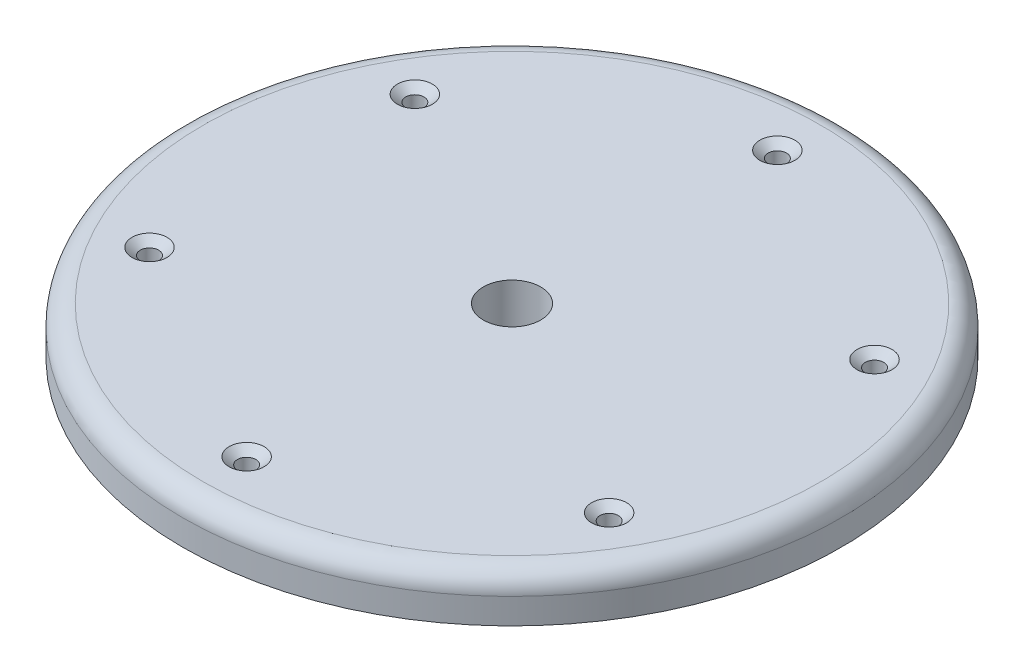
ISO-10303-21;
HEADER;
FILE_DESCRIPTION(('STEP AP214'),'2;1');
FILE_NAME('part.step','',(''),(''),'','','');
FILE_SCHEMA(('AUTOMOTIVE_DESIGN { 1 0 10303 214 1 1 1 1 }'));
ENDSEC;
DATA;
#1=APPLICATION_CONTEXT('core data for automotive mechanical design processes');
#2=APPLICATION_PROTOCOL_DEFINITION('international standard','automotive_design',2000,#1);
#3=PRODUCT_CONTEXT('',#1,'mechanical');
#4=PRODUCT('Part','Part','',(#3));
#5=PRODUCT_RELATED_PRODUCT_CATEGORY('part','',(#4));
#6=PRODUCT_DEFINITION_FORMATION('','',#4);
#7=PRODUCT_DEFINITION_CONTEXT('part definition',#1,'design');
#8=PRODUCT_DEFINITION('design','',#6,#7);
#9=PRODUCT_DEFINITION_SHAPE('','',#8);
#10=(LENGTH_UNIT() NAMED_UNIT(*) SI_UNIT(.MILLI.,.METRE.));
#11=(NAMED_UNIT(*) PLANE_ANGLE_UNIT() SI_UNIT($,.RADIAN.));
#12=(NAMED_UNIT(*) SI_UNIT($,.STERADIAN.) SOLID_ANGLE_UNIT());
#13=UNCERTAINTY_MEASURE_WITH_UNIT(LENGTH_MEASURE(1.E-05),#10,'distance_accuracy_value','');
#14=(GEOMETRIC_REPRESENTATION_CONTEXT(3) GLOBAL_UNCERTAINTY_ASSIGNED_CONTEXT((#13)) GLOBAL_UNIT_ASSIGNED_CONTEXT((#10,
#11,#12)) REPRESENTATION_CONTEXT('',''));
#15=CARTESIAN_POINT('',(0.,0.,0.));
#16=DIRECTION('',(0.,0.,1.));
#17=DIRECTION('',(1.,0.,0.));
#18=AXIS2_PLACEMENT_3D('',#15,#16,#17);
#19=CARTESIAN_POINT('',(0.,17.018,0.));
#20=DIRECTION('',(0.,-1.,0.));
#21=DIRECTION('',(0.,0.,-1.));
#22=AXIS2_PLACEMENT_3D('',#19,#20,#21);
#23=CYLINDRICAL_SURFACE('',#22,121.229415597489);
#24=CARTESIAN_POINT('',(0.,9.398,0.));
#25=DIRECTION('',(0.,1.,0.));
#26=DIRECTION('',(0.,0.,1.));
#27=AXIS2_PLACEMENT_3D('',#24,#25,#26);
#28=CIRCLE('',#27,121.229415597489);
#29=CARTESIAN_POINT('',(0.,9.398,121.229415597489));
#30=VERTEX_POINT('',#29);
#31=EDGE_CURVE('E10',#30,#30,#28,.F.);
#32=ORIENTED_EDGE('',*,*,#31,.T.);
#33=EDGE_LOOP('',(#32));
#34=FACE_BOUND('',#33,.T.);
#35=CARTESIAN_POINT('',(0.,0.,0.));
#36=DIRECTION('',(0.,1.,0.));
#37=DIRECTION('',(0.,0.,1.));
#38=AXIS2_PLACEMENT_3D('',#35,#36,#37);
#39=CIRCLE('',#38,121.229415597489);
#40=CARTESIAN_POINT('',(0.,0.,121.229415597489));
#41=VERTEX_POINT('',#40);
#42=EDGE_CURVE('E42',#41,#41,#39,.T.);
#43=ORIENTED_EDGE('',*,*,#42,.T.);
#44=EDGE_LOOP('',(#43));
#45=FACE_BOUND('',#44,.T.);
#46=ADVANCED_FACE('F31',(#34,#45),#23,.T.);
#47=CARTESIAN_POINT('',(0.,17.018,0.));
#48=DIRECTION('',(0.,1.,0.));
#49=DIRECTION('',(0.,0.,1.));
#50=AXIS2_PLACEMENT_3D('',#47,#48,#49);
#51=PLANE('',#50);
#52=CARTESIAN_POINT('',(0.,17.018,0.));
#53=DIRECTION('',(0.,1.,0.));
#54=DIRECTION('',(0.,0.,1.));
#55=AXIS2_PLACEMENT_3D('',#52,#53,#54);
#56=CIRCLE('',#55,113.609415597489);
#57=CARTESIAN_POINT('',(0.,17.018,113.609415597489));
#58=VERTEX_POINT('',#57);
#59=EDGE_CURVE('E38',#58,#58,#56,.T.);
#60=ORIENTED_EDGE('',*,*,#59,.T.);
#61=EDGE_LOOP('',(#60));
#62=FACE_BOUND('',#61,.T.);
#63=CARTESIAN_POINT('',(-84.5411543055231,17.018,-48.8098581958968));
#64=DIRECTION('',(0.,1.,0.));
#65=DIRECTION('',(0.,0.,1.));
#66=AXIS2_PLACEMENT_3D('',#63,#64,#65);
#67=CIRCLE('',#66,6.4389);
#68=CARTESIAN_POINT('',(-84.5411543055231,17.018,-42.3709581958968));
#69=VERTEX_POINT('',#68);
#70=EDGE_CURVE('E105',#69,#69,#67,.T.);
#71=ORIENTED_EDGE('',*,*,#70,.F.);
#72=EDGE_LOOP('',(#71));
#73=FACE_BOUND('',#72,.T.);
#74=CARTESIAN_POINT('',(-84.5411543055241,17.018,48.809858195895));
#75=DIRECTION('',(0.,1.,0.));
#76=DIRECTION('',(0.,0.,1.));
#77=AXIS2_PLACEMENT_3D('',#74,#75,#76);
#78=CIRCLE('',#77,6.4389);
#79=CARTESIAN_POINT('',(-84.5411543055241,17.018,55.248758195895));
#80=VERTEX_POINT('',#79);
#81=EDGE_CURVE('E96',#80,#80,#78,.T.);
#82=ORIENTED_EDGE('',*,*,#81,.F.);
#83=EDGE_LOOP('',(#82));
#84=FACE_BOUND('',#83,.T.);
#85=CARTESIAN_POINT('',(84.5411543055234,17.018,48.8098581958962));
#86=DIRECTION('',(0.,1.,0.));
#87=DIRECTION('',(0.,0.,1.));
#88=AXIS2_PLACEMENT_3D('',#85,#86,#87);
#89=CIRCLE('',#88,6.4389);
#90=CARTESIAN_POINT('',(84.5411543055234,17.018,55.2487581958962));
#91=VERTEX_POINT('',#90);
#92=EDGE_CURVE('E87',#91,#91,#89,.T.);
#93=ORIENTED_EDGE('',*,*,#92,.F.);
#94=EDGE_LOOP('',(#93));
#95=FACE_BOUND('',#94,.T.);
#96=CARTESIAN_POINT('',(84.5411543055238,17.018,-48.8098581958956));
#97=DIRECTION('',(0.,1.,0.));
#98=DIRECTION('',(0.,0.,1.));
#99=AXIS2_PLACEMENT_3D('',#96,#97,#98);
#100=CIRCLE('',#99,6.4389);
#101=CARTESIAN_POINT('',(84.5411543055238,17.018,-42.3709581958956));
#102=VERTEX_POINT('',#101);
#103=EDGE_CURVE('E78',#102,#102,#100,.T.);
#104=ORIENTED_EDGE('',*,*,#103,.F.);
#105=EDGE_LOOP('',(#104));
#106=FACE_BOUND('',#105,.T.);
#107=CARTESIAN_POINT('',(0.,17.018,0.));
#108=DIRECTION('',(0.,1.,0.));
#109=DIRECTION('',(0.,0.,1.));
#110=AXIS2_PLACEMENT_3D('',#107,#108,#109);
#111=CIRCLE('',#110,10.5620076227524);
#112=CARTESIAN_POINT('',(0.,17.018,10.5620076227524));
#113=VERTEX_POINT('',#112);
#114=EDGE_CURVE('E67',#113,#113,#111,.T.);
#115=ORIENTED_EDGE('',*,*,#114,.F.);
#116=EDGE_LOOP('',(#115));
#117=FACE_BOUND('',#116,.T.);
#118=CARTESIAN_POINT('',(0.,17.018,97.6197163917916));
#119=DIRECTION('',(0.,1.,0.));
#120=DIRECTION('',(0.,0.,1.));
#121=AXIS2_PLACEMENT_3D('',#118,#119,#120);
#122=CIRCLE('',#121,6.4389);
#123=CARTESIAN_POINT('',(0.,17.018,104.058616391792));
#124=VERTEX_POINT('',#123);
#125=EDGE_CURVE('E63',#124,#124,#122,.T.);
#126=ORIENTED_EDGE('',*,*,#125,.F.);
#127=EDGE_LOOP('',(#126));
#128=FACE_BOUND('',#127,.T.);
#129=CARTESIAN_POINT('',(0.,17.018,-97.6197163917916));
#130=DIRECTION('',(0.,1.,0.));
#131=DIRECTION('',(0.,0.,1.));
#132=AXIS2_PLACEMENT_3D('',#129,#130,#131);
#133=CIRCLE('',#132,6.4389);
#134=CARTESIAN_POINT('',(0.,17.018,-91.1808163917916));
#135=VERTEX_POINT('',#134);
#136=EDGE_CURVE('E54',#135,#135,#133,.T.);
#137=ORIENTED_EDGE('',*,*,#136,.F.);
#138=EDGE_LOOP('',(#137));
#139=FACE_BOUND('',#138,.T.);
#140=ADVANCED_FACE('F111',(#62,#73,#84,#95,#106,#117,#128,#139),#51,.T.);
#141=CARTESIAN_POINT('',(0.,0.,0.));
#142=DIRECTION('',(0.,1.,0.));
#143=DIRECTION('',(0.,0.,1.));
#144=AXIS2_PLACEMENT_3D('',#141,#142,#143);
#145=PLANE('',#144);
#146=CARTESIAN_POINT('',(-84.5411543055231,0.,-48.8098581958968));
#147=DIRECTION('',(0.,1.,0.));
#148=DIRECTION('',(0.,0.,1.));
#149=AXIS2_PLACEMENT_3D('',#146,#147,#148);
#150=CIRCLE('',#149,3.3782);
#151=CARTESIAN_POINT('',(-84.5411543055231,0.,-45.4316581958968));
#152=VERTEX_POINT('',#151);
#153=EDGE_CURVE('E99',#152,#152,#150,.T.);
#154=ORIENTED_EDGE('',*,*,#153,.T.);
#155=EDGE_LOOP('',(#154));
#156=FACE_BOUND('',#155,.T.);
#157=CARTESIAN_POINT('',(-84.5411543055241,0.,48.809858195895));
#158=DIRECTION('',(0.,1.,0.));
#159=DIRECTION('',(0.,0.,1.));
#160=AXIS2_PLACEMENT_3D('',#157,#158,#159);
#161=CIRCLE('',#160,3.3782);
#162=CARTESIAN_POINT('',(-84.5411543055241,0.,52.188058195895));
#163=VERTEX_POINT('',#162);
#164=EDGE_CURVE('E90',#163,#163,#161,.T.);
#165=ORIENTED_EDGE('',*,*,#164,.T.);
#166=EDGE_LOOP('',(#165));
#167=FACE_BOUND('',#166,.T.);
#168=CARTESIAN_POINT('',(84.5411543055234,0.,48.8098581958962));
#169=DIRECTION('',(0.,1.,0.));
#170=DIRECTION('',(0.,0.,1.));
#171=AXIS2_PLACEMENT_3D('',#168,#169,#170);
#172=CIRCLE('',#171,3.3782);
#173=CARTESIAN_POINT('',(84.5411543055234,0.,52.1880581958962));
#174=VERTEX_POINT('',#173);
#175=EDGE_CURVE('E81',#174,#174,#172,.T.);
#176=ORIENTED_EDGE('',*,*,#175,.T.);
#177=EDGE_LOOP('',(#176));
#178=FACE_BOUND('',#177,.T.);
#179=CARTESIAN_POINT('',(84.5411543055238,0.,-48.8098581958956));
#180=DIRECTION('',(0.,1.,0.));
#181=DIRECTION('',(0.,0.,1.));
#182=AXIS2_PLACEMENT_3D('',#179,#180,#181);
#183=CIRCLE('',#182,3.3782);
#184=CARTESIAN_POINT('',(84.5411543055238,0.,-45.4316581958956));
#185=VERTEX_POINT('',#184);
#186=EDGE_CURVE('E70',#185,#185,#183,.T.);
#187=ORIENTED_EDGE('',*,*,#186,.T.);
#188=EDGE_LOOP('',(#187));
#189=FACE_BOUND('',#188,.T.);
#190=CARTESIAN_POINT('',(0.,0.,0.));
#191=DIRECTION('',(0.,1.,0.));
#192=DIRECTION('',(0.,0.,1.));
#193=AXIS2_PLACEMENT_3D('',#190,#191,#192);
#194=CIRCLE('',#193,10.5620076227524);
#195=CARTESIAN_POINT('',(0.,0.,10.5620076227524));
#196=VERTEX_POINT('',#195);
#197=EDGE_CURVE('E66',#196,#196,#194,.T.);
#198=ORIENTED_EDGE('',*,*,#197,.T.);
#199=EDGE_LOOP('',(#198));
#200=FACE_BOUND('',#199,.T.);
#201=CARTESIAN_POINT('',(0.,0.,97.6197163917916));
#202=DIRECTION('',(0.,1.,0.));
#203=DIRECTION('',(0.,0.,1.));
#204=AXIS2_PLACEMENT_3D('',#201,#202,#203);
#205=CIRCLE('',#204,3.3782);
#206=CARTESIAN_POINT('',(0.,0.,100.997916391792));
#207=VERTEX_POINT('',#206);
#208=EDGE_CURVE('E57',#207,#207,#205,.T.);
#209=ORIENTED_EDGE('',*,*,#208,.T.);
#210=EDGE_LOOP('',(#209));
#211=FACE_BOUND('',#210,.T.);
#212=CARTESIAN_POINT('',(0.,0.,-97.6197163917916));
#213=DIRECTION('',(0.,1.,0.));
#214=DIRECTION('',(0.,0.,1.));
#215=AXIS2_PLACEMENT_3D('',#212,#213,#214);
#216=CIRCLE('',#215,3.3782);
#217=CARTESIAN_POINT('',(0.,0.,-94.2415163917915));
#218=VERTEX_POINT('',#217);
#219=EDGE_CURVE('E46',#218,#218,#216,.T.);
#220=ORIENTED_EDGE('',*,*,#219,.T.);
#221=EDGE_LOOP('',(#220));
#222=FACE_BOUND('',#221,.T.);
#223=ORIENTED_EDGE('',*,*,#42,.F.);
#224=EDGE_LOOP('',(#223));
#225=FACE_BOUND('',#224,.T.);
#226=ADVANCED_FACE('F114',(#156,#167,#178,#189,#200,#211,#222,#225),#145,.F.);
#227=CARTESIAN_POINT('',(0.,17.018,-97.6197163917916));
#228=DIRECTION('',(0.,1.,0.));
#229=DIRECTION('',(0.,0.,1.));
#230=AXIS2_PLACEMENT_3D('',#227,#228,#229);
#231=CYLINDRICAL_SURFACE('',#230,3.3782);
#232=ORIENTED_EDGE('',*,*,#219,.F.);
#233=EDGE_LOOP('',(#232));
#234=FACE_BOUND('',#233,.T.);
#235=CARTESIAN_POINT('',(0.,14.4497677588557,-97.6197163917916));
#236=DIRECTION('',(0.,1.,0.));
#237=DIRECTION('',(0.,0.,1.));
#238=AXIS2_PLACEMENT_3D('',#235,#236,#237);
#239=CIRCLE('',#238,3.3782);
#240=CARTESIAN_POINT('',(0.,14.4497677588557,-94.2415163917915));
#241=VERTEX_POINT('',#240);
#242=EDGE_CURVE('E51',#241,#241,#239,.T.);
#243=ORIENTED_EDGE('',*,*,#242,.T.);
#244=EDGE_LOOP('',(#243));
#245=FACE_BOUND('',#244,.T.);
#246=ADVANCED_FACE('F131',(#234,#245),#231,.F.);
#247=CARTESIAN_POINT('',(0.,17.018,-97.6197163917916));
#248=DIRECTION('',(0.,1.,0.));
#249=DIRECTION('',(0.,0.,1.));
#250=AXIS2_PLACEMENT_3D('',#247,#248,#249);
#251=CONICAL_SURFACE('',#250,6.4389,0.872664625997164);
#252=ORIENTED_EDGE('',*,*,#242,.F.);
#253=EDGE_LOOP('',(#252));
#254=FACE_BOUND('',#253,.T.);
#255=ORIENTED_EDGE('',*,*,#136,.T.);
#256=EDGE_LOOP('',(#255));
#257=FACE_BOUND('',#256,.T.);
#258=ADVANCED_FACE('F128',(#254,#257),#251,.F.);
#259=CARTESIAN_POINT('',(0.,17.018,97.6197163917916));
#260=DIRECTION('',(0.,1.,0.));
#261=DIRECTION('',(0.,0.,1.));
#262=AXIS2_PLACEMENT_3D('',#259,#260,#261);
#263=CYLINDRICAL_SURFACE('',#262,3.3782);
#264=ORIENTED_EDGE('',*,*,#208,.F.);
#265=EDGE_LOOP('',(#264));
#266=FACE_BOUND('',#265,.T.);
#267=CARTESIAN_POINT('',(0.,14.4497677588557,97.6197163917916));
#268=DIRECTION('',(0.,1.,0.));
#269=DIRECTION('',(0.,0.,1.));
#270=AXIS2_PLACEMENT_3D('',#267,#268,#269);
#271=CIRCLE('',#270,3.3782);
#272=CARTESIAN_POINT('',(0.,14.4497677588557,100.997916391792));
#273=VERTEX_POINT('',#272);
#274=EDGE_CURVE('E60',#273,#273,#271,.T.);
#275=ORIENTED_EDGE('',*,*,#274,.T.);
#276=EDGE_LOOP('',(#275));
#277=FACE_BOUND('',#276,.T.);
#278=ADVANCED_FACE('F130',(#266,#277),#263,.F.);
#279=CARTESIAN_POINT('',(0.,17.018,97.6197163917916));
#280=DIRECTION('',(0.,1.,0.));
#281=DIRECTION('',(0.,0.,1.));
#282=AXIS2_PLACEMENT_3D('',#279,#280,#281);
#283=CONICAL_SURFACE('',#282,6.4389,0.872664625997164);
#284=ORIENTED_EDGE('',*,*,#274,.F.);
#285=EDGE_LOOP('',(#284));
#286=FACE_BOUND('',#285,.T.);
#287=ORIENTED_EDGE('',*,*,#125,.T.);
#288=EDGE_LOOP('',(#287));
#289=FACE_BOUND('',#288,.T.);
#290=ADVANCED_FACE('F138',(#286,#289),#283,.F.);
#291=CARTESIAN_POINT('',(0.,0.,0.));
#292=DIRECTION('',(0.,1.,0.));
#293=DIRECTION('',(0.,0.,1.));
#294=AXIS2_PLACEMENT_3D('',#291,#292,#293);
#295=CYLINDRICAL_SURFACE('',#294,10.5620076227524);
#296=ORIENTED_EDGE('',*,*,#197,.F.);
#297=EDGE_LOOP('',(#296));
#298=FACE_BOUND('',#297,.T.);
#299=ORIENTED_EDGE('',*,*,#114,.T.);
#300=EDGE_LOOP('',(#299));
#301=FACE_BOUND('',#300,.T.);
#302=ADVANCED_FACE('F174',(#298,#301),#295,.F.);
#303=CARTESIAN_POINT('',(84.5411543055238,17.018,-48.8098581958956));
#304=DIRECTION('',(0.,1.,0.));
#305=DIRECTION('',(0.,0.,1.));
#306=AXIS2_PLACEMENT_3D('',#303,#304,#305);
#307=CYLINDRICAL_SURFACE('',#306,3.3782);
#308=ORIENTED_EDGE('',*,*,#186,.F.);
#309=EDGE_LOOP('',(#308));
#310=FACE_BOUND('',#309,.T.);
#311=CARTESIAN_POINT('',(84.5411543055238,14.4497677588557,-48.8098581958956));
#312=DIRECTION('',(0.,1.,0.));
#313=DIRECTION('',(0.,0.,1.));
#314=AXIS2_PLACEMENT_3D('',#311,#312,#313);
#315=CIRCLE('',#314,3.3782);
#316=CARTESIAN_POINT('',(84.5411543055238,14.4497677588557,-45.4316581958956));
#317=VERTEX_POINT('',#316);
#318=EDGE_CURVE('E75',#317,#317,#315,.T.);
#319=ORIENTED_EDGE('',*,*,#318,.T.);
#320=EDGE_LOOP('',(#319));
#321=FACE_BOUND('',#320,.T.);
#322=ADVANCED_FACE('F179',(#310,#321),#307,.F.);
#323=CARTESIAN_POINT('',(84.5411543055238,17.018,-48.8098581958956));
#324=DIRECTION('',(0.,1.,0.));
#325=DIRECTION('',(0.,0.,1.));
#326=AXIS2_PLACEMENT_3D('',#323,#324,#325);
#327=CONICAL_SURFACE('',#326,6.4389,0.872664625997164);
#328=ORIENTED_EDGE('',*,*,#318,.F.);
#329=EDGE_LOOP('',(#328));
#330=FACE_BOUND('',#329,.T.);
#331=ORIENTED_EDGE('',*,*,#103,.T.);
#332=EDGE_LOOP('',(#331));
#333=FACE_BOUND('',#332,.T.);
#334=ADVANCED_FACE('F185',(#330,#333),#327,.F.);
#335=CARTESIAN_POINT('',(84.5411543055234,17.018,48.8098581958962));
#336=DIRECTION('',(0.,1.,0.));
#337=DIRECTION('',(0.,0.,1.));
#338=AXIS2_PLACEMENT_3D('',#335,#336,#337);
#339=CYLINDRICAL_SURFACE('',#338,3.3782);
#340=ORIENTED_EDGE('',*,*,#175,.F.);
#341=EDGE_LOOP('',(#340));
#342=FACE_BOUND('',#341,.T.);
#343=CARTESIAN_POINT('',(84.5411543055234,14.4497677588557,48.8098581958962));
#344=DIRECTION('',(0.,1.,0.));
#345=DIRECTION('',(0.,0.,1.));
#346=AXIS2_PLACEMENT_3D('',#343,#344,#345);
#347=CIRCLE('',#346,3.3782);
#348=CARTESIAN_POINT('',(84.5411543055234,14.4497677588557,52.1880581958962));
#349=VERTEX_POINT('',#348);
#350=EDGE_CURVE('E84',#349,#349,#347,.T.);
#351=ORIENTED_EDGE('',*,*,#350,.T.);
#352=EDGE_LOOP('',(#351));
#353=FACE_BOUND('',#352,.T.);
#354=ADVANCED_FACE('F189',(#342,#353),#339,.F.);
#355=CARTESIAN_POINT('',(84.5411543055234,17.018,48.8098581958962));
#356=DIRECTION('',(0.,1.,0.));
#357=DIRECTION('',(0.,0.,1.));
#358=AXIS2_PLACEMENT_3D('',#355,#356,#357);
#359=CONICAL_SURFACE('',#358,6.4389,0.872664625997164);
#360=ORIENTED_EDGE('',*,*,#350,.F.);
#361=EDGE_LOOP('',(#360));
#362=FACE_BOUND('',#361,.T.);
#363=ORIENTED_EDGE('',*,*,#92,.T.);
#364=EDGE_LOOP('',(#363));
#365=FACE_BOUND('',#364,.T.);
#366=ADVANCED_FACE('F193',(#362,#365),#359,.F.);
#367=CARTESIAN_POINT('',(-84.5411543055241,17.018,48.809858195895));
#368=DIRECTION('',(0.,1.,0.));
#369=DIRECTION('',(0.,0.,1.));
#370=AXIS2_PLACEMENT_3D('',#367,#368,#369);
#371=CYLINDRICAL_SURFACE('',#370,3.3782);
#372=ORIENTED_EDGE('',*,*,#164,.F.);
#373=EDGE_LOOP('',(#372));
#374=FACE_BOUND('',#373,.T.);
#375=CARTESIAN_POINT('',(-84.5411543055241,14.4497677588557,48.809858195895));
#376=DIRECTION('',(0.,1.,0.));
#377=DIRECTION('',(0.,0.,1.));
#378=AXIS2_PLACEMENT_3D('',#375,#376,#377);
#379=CIRCLE('',#378,3.3782);
#380=CARTESIAN_POINT('',(-84.5411543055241,14.4497677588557,52.188058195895));
#381=VERTEX_POINT('',#380);
#382=EDGE_CURVE('E93',#381,#381,#379,.T.);
#383=ORIENTED_EDGE('',*,*,#382,.T.);
#384=EDGE_LOOP('',(#383));
#385=FACE_BOUND('',#384,.T.);
#386=ADVANCED_FACE('F197',(#374,#385),#371,.F.);
#387=CARTESIAN_POINT('',(-84.5411543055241,17.018,48.809858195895));
#388=DIRECTION('',(0.,1.,0.));
#389=DIRECTION('',(0.,0.,1.));
#390=AXIS2_PLACEMENT_3D('',#387,#388,#389);
#391=CONICAL_SURFACE('',#390,6.4389,0.872664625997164);
#392=ORIENTED_EDGE('',*,*,#382,.F.);
#393=EDGE_LOOP('',(#392));
#394=FACE_BOUND('',#393,.T.);
#395=ORIENTED_EDGE('',*,*,#81,.T.);
#396=EDGE_LOOP('',(#395));
#397=FACE_BOUND('',#396,.T.);
#398=ADVANCED_FACE('F201',(#394,#397),#391,.F.);
#399=CARTESIAN_POINT('',(-84.5411543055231,17.018,-48.8098581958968));
#400=DIRECTION('',(0.,1.,0.));
#401=DIRECTION('',(0.,0.,1.));
#402=AXIS2_PLACEMENT_3D('',#399,#400,#401);
#403=CYLINDRICAL_SURFACE('',#402,3.3782);
#404=ORIENTED_EDGE('',*,*,#153,.F.);
#405=EDGE_LOOP('',(#404));
#406=FACE_BOUND('',#405,.T.);
#407=CARTESIAN_POINT('',(-84.5411543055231,14.4497677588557,-48.8098581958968));
#408=DIRECTION('',(0.,1.,0.));
#409=DIRECTION('',(0.,0.,1.));
#410=AXIS2_PLACEMENT_3D('',#407,#408,#409);
#411=CIRCLE('',#410,3.3782);
#412=CARTESIAN_POINT('',(-84.5411543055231,14.4497677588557,-45.4316581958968));
#413=VERTEX_POINT('',#412);
#414=EDGE_CURVE('E102',#413,#413,#411,.T.);
#415=ORIENTED_EDGE('',*,*,#414,.T.);
#416=EDGE_LOOP('',(#415));
#417=FACE_BOUND('',#416,.T.);
#418=ADVANCED_FACE('F205',(#406,#417),#403,.F.);
#419=CARTESIAN_POINT('',(-84.5411543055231,17.018,-48.8098581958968));
#420=DIRECTION('',(0.,1.,0.));
#421=DIRECTION('',(0.,0.,1.));
#422=AXIS2_PLACEMENT_3D('',#419,#420,#421);
#423=CONICAL_SURFACE('',#422,6.4389,0.872664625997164);
#424=ORIENTED_EDGE('',*,*,#414,.F.);
#425=EDGE_LOOP('',(#424));
#426=FACE_BOUND('',#425,.T.);
#427=ORIENTED_EDGE('',*,*,#70,.T.);
#428=EDGE_LOOP('',(#427));
#429=FACE_BOUND('',#428,.T.);
#430=ADVANCED_FACE('F109',(#426,#429),#423,.F.);
#431=CARTESIAN_POINT('',(0.,9.398,0.));
#432=DIRECTION('',(0.,1.,0.));
#433=DIRECTION('',(0.,0.,1.));
#434=AXIS2_PLACEMENT_3D('',#431,#432,#433);
#435=TOROIDAL_SURFACE('',#434,113.609415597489,7.62);
#436=ORIENTED_EDGE('',*,*,#31,.F.);
#437=EDGE_LOOP('',(#436));
#438=FACE_BOUND('',#437,.T.);
#439=ORIENTED_EDGE('',*,*,#59,.F.);
#440=EDGE_LOOP('',(#439));
#441=FACE_BOUND('',#440,.T.);
#442=ADVANCED_FACE('F33',(#438,#441),#435,.T.);
#443=CLOSED_SHELL('',(#46,#140,#226,#246,#258,#278,#290,#302,#322,#334,#354,#366,#386,#398,#418,
#430,#442));
#444=MANIFOLD_SOLID_BREP('B2',#443);
#445=ADVANCED_BREP_SHAPE_REPRESENTATION('',(#18,#444),#14);
#446=SHAPE_DEFINITION_REPRESENTATION(#9,#445);
ENDSEC;
END-ISO-10303-21;
